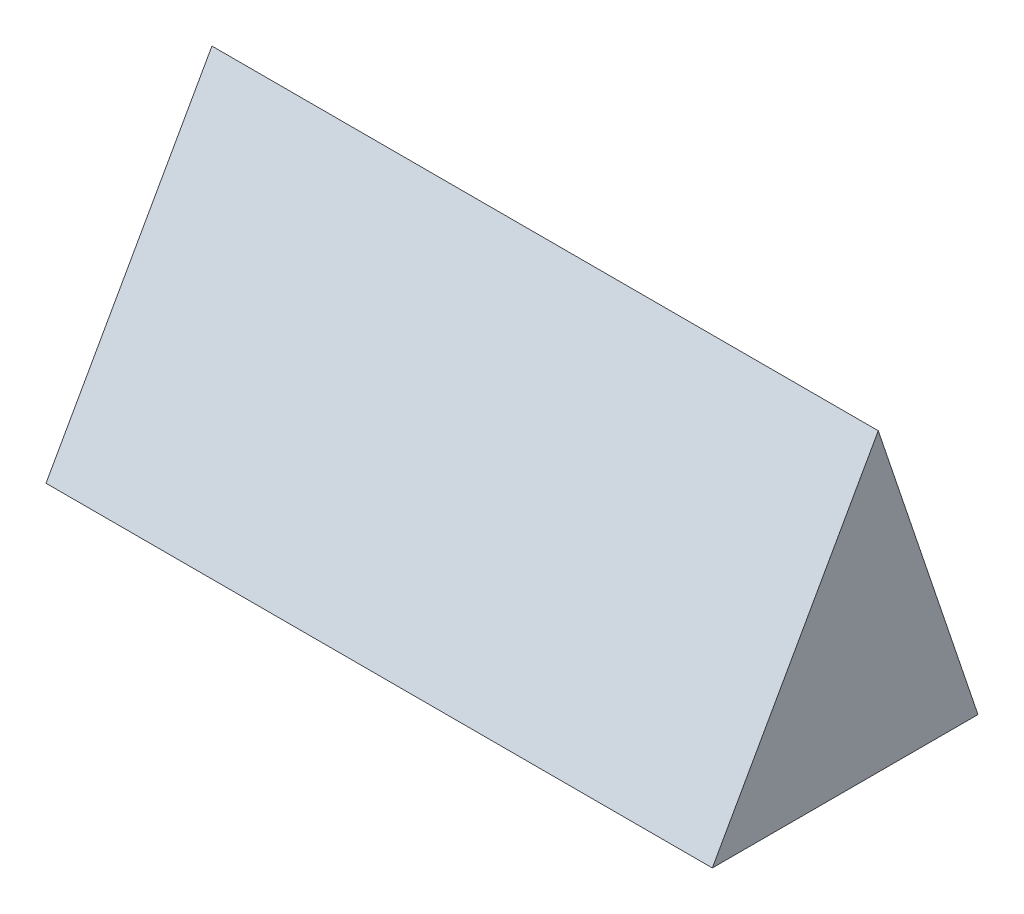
from build123d import *


with BuildPart() as part:
    # Sweep2: sweep along a path in Sketch2
    with BuildLine(Plane.XY) as sweep2_path:
        Line((0, 26.925280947), (148.821682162, 26.925280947))
    # Sketch1 → Sweep2 (sweep)
    with BuildSketch(Plane(origin=(0, 0, 0), x_dir=(0, 0, -1), z_dir=(1, 0, 0))):
        Polygon((-37.061193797, 0), (0, 66.04), (22.276389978, 0), align=None)
    sweep(path=sweep2_path.line)


solid = part.part
